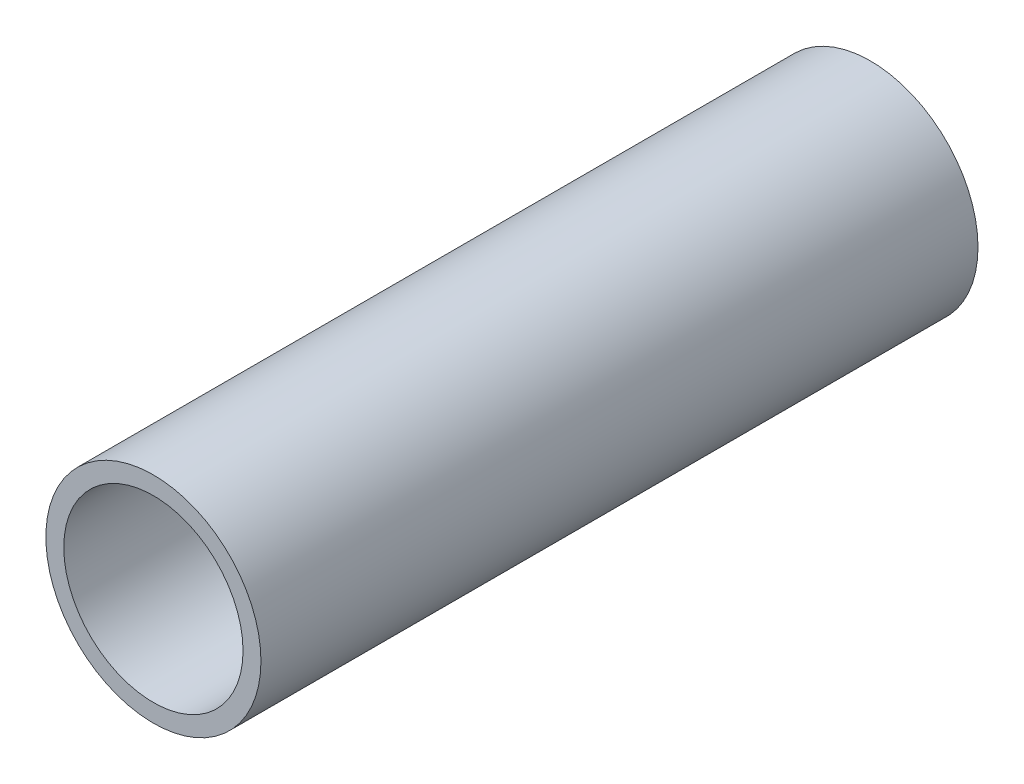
from build123d import *

# Parameters (mm, degrees)
ESQUISSE1_R      = 6
ESQUISSE1_R_2    = 5
EXTRUSION1_DEPTH = 20


with BuildPart() as part:
    # Esquisse1 → Extrusion1 (new, symmetric)
    with BuildSketch(Plane.XY):
        Circle(ESQUISSE1_R)
        Circle(ESQUISSE1_R_2, mode=Mode.SUBTRACT)
    extrude(amount=EXTRUSION1_DEPTH, both=True)


solid = part.part
